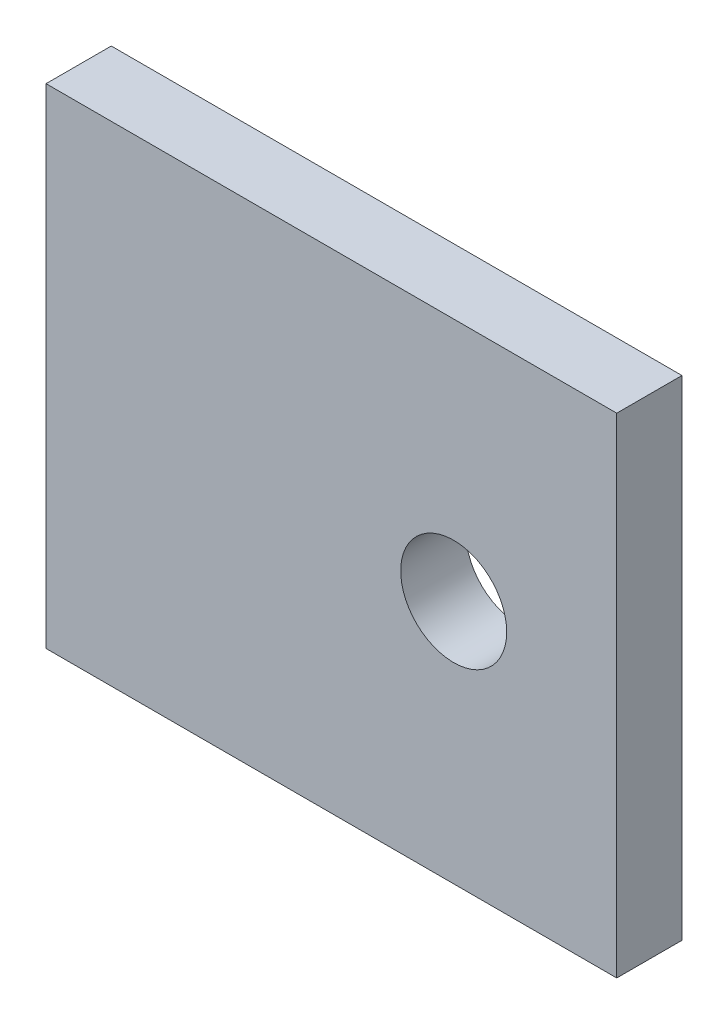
ISO-10303-21;
HEADER;
FILE_DESCRIPTION(('STEP AP214'),'2;1');
FILE_NAME('part.step','',(''),(''),'','','');
FILE_SCHEMA(('AUTOMOTIVE_DESIGN { 1 0 10303 214 1 1 1 1 }'));
ENDSEC;
DATA;
#1=APPLICATION_CONTEXT('core data for automotive mechanical design processes');
#2=APPLICATION_PROTOCOL_DEFINITION('international standard','automotive_design',2000,#1);
#3=PRODUCT_CONTEXT('',#1,'mechanical');
#4=PRODUCT('Part','Part','',(#3));
#5=PRODUCT_RELATED_PRODUCT_CATEGORY('part','',(#4));
#6=PRODUCT_DEFINITION_FORMATION('','',#4);
#7=PRODUCT_DEFINITION_CONTEXT('part definition',#1,'design');
#8=PRODUCT_DEFINITION('design','',#6,#7);
#9=PRODUCT_DEFINITION_SHAPE('','',#8);
#10=(LENGTH_UNIT() NAMED_UNIT(*) SI_UNIT(.MILLI.,.METRE.));
#11=(NAMED_UNIT(*) PLANE_ANGLE_UNIT() SI_UNIT($,.RADIAN.));
#12=(NAMED_UNIT(*) SI_UNIT($,.STERADIAN.) SOLID_ANGLE_UNIT());
#13=UNCERTAINTY_MEASURE_WITH_UNIT(LENGTH_MEASURE(1.E-05),#10,'distance_accuracy_value','');
#14=(GEOMETRIC_REPRESENTATION_CONTEXT(3) GLOBAL_UNCERTAINTY_ASSIGNED_CONTEXT((#13)) GLOBAL_UNIT_ASSIGNED_CONTEXT((#10,
#11,#12)) REPRESENTATION_CONTEXT('',''));
#15=CARTESIAN_POINT('',(0.,0.,0.));
#16=DIRECTION('',(0.,0.,1.));
#17=DIRECTION('',(1.,0.,0.));
#18=AXIS2_PLACEMENT_3D('',#15,#16,#17);
#19=CARTESIAN_POINT('',(0.,60.,8.));
#20=DIRECTION('',(0.,0.,-1.));
#21=DIRECTION('',(-1.,0.,0.));
#22=AXIS2_PLACEMENT_3D('',#19,#20,#21);
#23=PLANE('',#22);
#24=DIRECTION('',(0.,-1.,0.));
#25=VECTOR('',#24,1.);
#26=CARTESIAN_POINT('',(0.,0.,8.));
#27=LINE('',#26,#25);
#28=CARTESIAN_POINT('',(0.,60.,8.));
#29=VERTEX_POINT('',#28);
#30=CARTESIAN_POINT('',(0.,0.,8.));
#31=VERTEX_POINT('',#30);
#32=EDGE_CURVE('E91',#29,#31,#27,.T.);
#33=ORIENTED_EDGE('',*,*,#32,.T.);
#34=DIRECTION('',(1.,0.,0.));
#35=VECTOR('',#34,1.);
#36=CARTESIAN_POINT('',(0.,0.,8.));
#37=LINE('',#36,#35);
#38=CARTESIAN_POINT('',(70.,0.,8.));
#39=VERTEX_POINT('',#38);
#40=EDGE_CURVE('E86',#31,#39,#37,.T.);
#41=ORIENTED_EDGE('',*,*,#40,.T.);
#42=DIRECTION('',(0.,1.,0.));
#43=VECTOR('',#42,1.);
#44=CARTESIAN_POINT('',(70.,0.,8.));
#45=LINE('',#44,#43);
#46=CARTESIAN_POINT('',(70.,60.,8.));
#47=VERTEX_POINT('',#46);
#48=EDGE_CURVE('E89',#39,#47,#45,.T.);
#49=ORIENTED_EDGE('',*,*,#48,.T.);
#50=DIRECTION('',(-1.,0.,0.));
#51=VECTOR('',#50,1.);
#52=CARTESIAN_POINT('',(0.,60.,8.));
#53=LINE('',#52,#51);
#54=EDGE_CURVE('E56',#47,#29,#53,.T.);
#55=ORIENTED_EDGE('',*,*,#54,.T.);
#56=EDGE_LOOP('',(#33,#41,#49,#55));
#57=FACE_BOUND('',#56,.T.);
#58=CARTESIAN_POINT('',(50.,30.,8.));
#59=DIRECTION('',(0.,0.,1.));
#60=DIRECTION('',(1.,0.,0.));
#61=AXIS2_PLACEMENT_3D('',#58,#59,#60);
#62=CIRCLE('',#61,6.5);
#63=CARTESIAN_POINT('',(56.5,30.,8.));
#64=VERTEX_POINT('',#63);
#65=EDGE_CURVE('E106',#64,#64,#62,.T.);
#66=ORIENTED_EDGE('',*,*,#65,.F.);
#67=EDGE_LOOP('',(#66));
#68=FACE_BOUND('',#67,.T.);
#69=ADVANCED_FACE('F39',(#57,#68),#23,.F.);
#70=CARTESIAN_POINT('',(0.,60.,0.));
#71=DIRECTION('',(0.,0.,-1.));
#72=DIRECTION('',(-1.,0.,0.));
#73=AXIS2_PLACEMENT_3D('',#70,#71,#72);
#74=PLANE('',#73);
#75=DIRECTION('',(0.,-1.,0.));
#76=VECTOR('',#75,1.);
#77=CARTESIAN_POINT('',(0.,0.,0.));
#78=LINE('',#77,#76);
#79=CARTESIAN_POINT('',(0.,60.,0.));
#80=VERTEX_POINT('',#79);
#81=CARTESIAN_POINT('',(0.,0.,0.));
#82=VERTEX_POINT('',#81);
#83=EDGE_CURVE('E103',#80,#82,#78,.T.);
#84=ORIENTED_EDGE('',*,*,#83,.F.);
#85=DIRECTION('',(-1.,0.,0.));
#86=VECTOR('',#85,1.);
#87=CARTESIAN_POINT('',(0.,60.,0.));
#88=LINE('',#87,#86);
#89=CARTESIAN_POINT('',(70.,60.,0.));
#90=VERTEX_POINT('',#89);
#91=EDGE_CURVE('E79',#90,#80,#88,.T.);
#92=ORIENTED_EDGE('',*,*,#91,.F.);
#93=DIRECTION('',(0.,1.,0.));
#94=VECTOR('',#93,1.);
#95=CARTESIAN_POINT('',(70.,0.,0.));
#96=LINE('',#95,#94);
#97=CARTESIAN_POINT('',(70.,0.,0.));
#98=VERTEX_POINT('',#97);
#99=EDGE_CURVE('E73',#98,#90,#96,.T.);
#100=ORIENTED_EDGE('',*,*,#99,.F.);
#101=DIRECTION('',(1.,0.,0.));
#102=VECTOR('',#101,1.);
#103=CARTESIAN_POINT('',(0.,0.,0.));
#104=LINE('',#103,#102);
#105=EDGE_CURVE('E95',#82,#98,#104,.T.);
#106=ORIENTED_EDGE('',*,*,#105,.F.);
#107=EDGE_LOOP('',(#84,#92,#100,#106));
#108=FACE_BOUND('',#107,.T.);
#109=CARTESIAN_POINT('',(50.,30.,0.));
#110=DIRECTION('',(0.,0.,1.));
#111=DIRECTION('',(1.,0.,0.));
#112=AXIS2_PLACEMENT_3D('',#109,#110,#111);
#113=CIRCLE('',#112,6.5);
#114=CARTESIAN_POINT('',(56.5,30.,0.));
#115=VERTEX_POINT('',#114);
#116=EDGE_CURVE('E118',#115,#115,#113,.T.);
#117=ORIENTED_EDGE('',*,*,#116,.T.);
#118=EDGE_LOOP('',(#117));
#119=FACE_BOUND('',#118,.T.);
#120=ADVANCED_FACE('F114',(#108,#119),#74,.T.);
#121=CARTESIAN_POINT('',(0.,0.,8.));
#122=DIRECTION('',(1.,0.,0.));
#123=DIRECTION('',(0.,0.,-1.));
#124=AXIS2_PLACEMENT_3D('',#121,#122,#123);
#125=PLANE('',#124);
#126=ORIENTED_EDGE('',*,*,#83,.T.);
#127=DIRECTION('',(0.,0.,-1.));
#128=VECTOR('',#127,1.);
#129=CARTESIAN_POINT('',(0.,0.,8.));
#130=LINE('',#129,#128);
#131=EDGE_CURVE('E11',#31,#82,#130,.T.);
#132=ORIENTED_EDGE('',*,*,#131,.F.);
#133=ORIENTED_EDGE('',*,*,#32,.F.);
#134=DIRECTION('',(0.,0.,-1.));
#135=VECTOR('',#134,1.);
#136=CARTESIAN_POINT('',(0.,60.,8.));
#137=LINE('',#136,#135);
#138=EDGE_CURVE('E99',#29,#80,#137,.T.);
#139=ORIENTED_EDGE('',*,*,#138,.T.);
#140=EDGE_LOOP('',(#126,#132,#133,#139));
#141=FACE_BOUND('',#140,.T.);
#142=ADVANCED_FACE('F41',(#141),#125,.F.);
#143=CARTESIAN_POINT('',(0.,0.,8.));
#144=DIRECTION('',(0.,1.,0.));
#145=DIRECTION('',(0.,0.,1.));
#146=AXIS2_PLACEMENT_3D('',#143,#144,#145);
#147=PLANE('',#146);
#148=ORIENTED_EDGE('',*,*,#105,.T.);
#149=DIRECTION('',(0.,0.,-1.));
#150=VECTOR('',#149,1.);
#151=CARTESIAN_POINT('',(70.,0.,8.));
#152=LINE('',#151,#150);
#153=EDGE_CURVE('E48',#39,#98,#152,.T.);
#154=ORIENTED_EDGE('',*,*,#153,.F.);
#155=ORIENTED_EDGE('',*,*,#40,.F.);
#156=ORIENTED_EDGE('',*,*,#131,.T.);
#157=EDGE_LOOP('',(#148,#154,#155,#156));
#158=FACE_BOUND('',#157,.T.);
#159=ADVANCED_FACE('F94',(#158),#147,.F.);
#160=CARTESIAN_POINT('',(70.,0.,8.));
#161=DIRECTION('',(-1.,0.,0.));
#162=DIRECTION('',(0.,0.,1.));
#163=AXIS2_PLACEMENT_3D('',#160,#161,#162);
#164=PLANE('',#163);
#165=ORIENTED_EDGE('',*,*,#99,.T.);
#166=DIRECTION('',(0.,0.,-1.));
#167=VECTOR('',#166,1.);
#168=CARTESIAN_POINT('',(70.,60.,8.));
#169=LINE('',#168,#167);
#170=EDGE_CURVE('E96',#47,#90,#169,.T.);
#171=ORIENTED_EDGE('',*,*,#170,.F.);
#172=ORIENTED_EDGE('',*,*,#48,.F.);
#173=ORIENTED_EDGE('',*,*,#153,.T.);
#174=EDGE_LOOP('',(#165,#171,#172,#173));
#175=FACE_BOUND('',#174,.T.);
#176=ADVANCED_FACE('F97',(#175),#164,.F.);
#177=CARTESIAN_POINT('',(0.,60.,8.));
#178=DIRECTION('',(0.,-1.,0.));
#179=DIRECTION('',(0.,0.,-1.));
#180=AXIS2_PLACEMENT_3D('',#177,#178,#179);
#181=PLANE('',#180);
#182=ORIENTED_EDGE('',*,*,#91,.T.);
#183=ORIENTED_EDGE('',*,*,#138,.F.);
#184=ORIENTED_EDGE('',*,*,#54,.F.);
#185=ORIENTED_EDGE('',*,*,#170,.T.);
#186=EDGE_LOOP('',(#182,#183,#184,#185));
#187=FACE_BOUND('',#186,.T.);
#188=ADVANCED_FACE('F111',(#187),#181,.F.);
#189=CARTESIAN_POINT('',(50.,30.,8.));
#190=DIRECTION('',(0.,0.,-1.));
#191=DIRECTION('',(-1.,0.,0.));
#192=AXIS2_PLACEMENT_3D('',#189,#190,#191);
#193=CYLINDRICAL_SURFACE('',#192,6.5);
#194=ORIENTED_EDGE('',*,*,#65,.T.);
#195=EDGE_LOOP('',(#194));
#196=FACE_BOUND('',#195,.T.);
#197=ORIENTED_EDGE('',*,*,#116,.F.);
#198=EDGE_LOOP('',(#197));
#199=FACE_BOUND('',#198,.T.);
#200=ADVANCED_FACE('F124',(#196,#199),#193,.F.);
#201=CLOSED_SHELL('',(#69,#120,#142,#159,#176,#188,#200));
#202=MANIFOLD_SOLID_BREP('B2',#201);
#203=ADVANCED_BREP_SHAPE_REPRESENTATION('',(#18,#202),#14);
#204=SHAPE_DEFINITION_REPRESENTATION(#9,#203);
ENDSEC;
END-ISO-10303-21;
